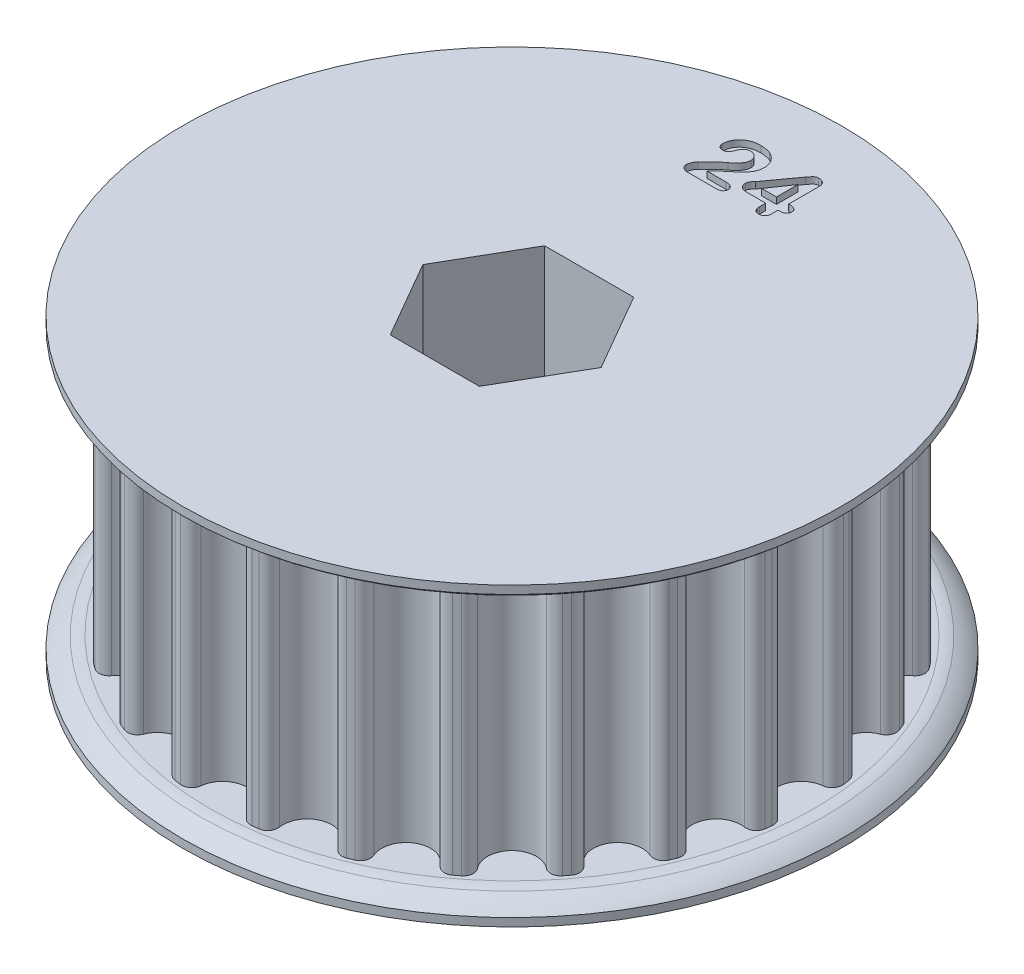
from build123d import *

# Parameters (mm, degrees)
SKETCH1_R               = 18.527092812
TOOTHOD_DEPTH           = 7.9375
TOOTHPROFILE_DEPTH      = 31.635305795
TOOTHPATTERN_COUNT      = 24
BORE_DEPTH              = 31.41244327
BORE_DEPTH_BACK         = 31.41244327
LARGE_TOOTH_COUNT_DEPTH = 0.4


with BuildPart() as part:
    # Sketch1 → ToothOD (new, symmetric)
    with BuildSketch(Plane(origin=(0, 0, 0), x_dir=(1, 0, 0), z_dir=(0, 1, 0))):
        with Locations(Location((0, 0, 0), (0, 0, 270))):
            Circle(SKETCH1_R)
    extrude(amount=TOOTHOD_DEPTH, both=True)

    # Sketch2 → ToothProfile (cut, through all)
    with BuildSketch(Plane(origin=(0, 7.9375, 0), x_dir=(1, 0, 0), z_dir=(0, 1, 0))):
        with BuildLine():
            ThreePointArc((-1.51637678, 17.83014695), (0, 16.467092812), (1.51637678, 17.83014695))
            ThreePointArc((1.51637678, 17.83014695), (1.752447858, 18.259636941), (2.224012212, 18.393122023))
            ThreePointArc((2.224012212, 18.393122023), (0, 18.527092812), (-2.224012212, 18.393122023))
            ThreePointArc((-2.224012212, 18.393122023), (-1.752447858, 18.259636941), (-1.51637678, 17.83014695))
        make_face()
    toothprofile = extrude(amount=-TOOTHPROFILE_DEPTH, mode=Mode.SUBTRACT)

    # ToothPattern: ToothProfile ×24 about axis
    toothpattern_axis = Axis((0, 0, 0), (0, 1, 0))
    for i in range(1, TOOTHPATTERN_COUNT):
        add(toothprofile.rotate(toothpattern_axis, i * 360 / TOOTHPATTERN_COUNT), mode=Mode.SUBTRACT)

    # Sketch4 → Flange (revolve)
    with BuildSketch(Plane.XY, mode=Mode.PRIVATE) as flange_sk:
        with BuildLine():
            Line((0, -7.9375), (18.781092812, -7.9375))
            ThreePointArc((18.781092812, -7.9375), (19.106848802, -7.963122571), (19.42666514, -8.030137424))
            ThreePointArc((19.42666514, -8.030137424), (19.994393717, -8.311697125), (20.495592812, -8.6995))
            Line((20.495592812, -8.6995), (20.495592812, -9.2075))
            Line((20.495592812, -9.2075), (0, -9.2075))
            Line((0, -9.2075), (0, -7.9375))
        make_face()
        with BuildLine():
            Line((20.495592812, 9.2075), (20.495592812, 8.6995))
            ThreePointArc((20.495592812, 8.6995), (19.994393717, 8.311697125), (19.42666514, 8.030137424))
            ThreePointArc((19.42666514, 8.030137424), (19.106848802, 7.963122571), (18.781092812, 7.9375))
            Line((18.781092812, 7.9375), (0, 7.9375))
            Line((0, 7.9375), (0, 9.2075))
            Line((0, 9.2075), (20.495592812, 9.2075))
        make_face()
    revolve(flange_sk.sketch.rotate(Axis((0, 7.858125, 0), (0, -1, 0)), 90), axis=Axis((0, 7.858125, 0), (0, -1, 0)))

    # Sketch7 → Bore (cut, two sides: drawn at the far end of the back side and taken through both)
    with BuildSketch(Plane.XZ.offset(-BORE_DEPTH_BACK)):
        Polygon((2.771627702, 4.8006), (-2.771627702, 4.8006), (-5.543255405, 0), (-2.771627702, -4.8006), (2.771627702, -4.8006), (5.543255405, 0), align=None)
    extrude(amount=BORE_DEPTH + BORE_DEPTH_BACK, mode=Mode.SUBTRACT)

    # Sketch9 → Large Tooth Count (cut)
    # profile 1 of 2: a face of its own
    with BuildSketch(Plane(origin=(0, 9.2075, 0), x_dir=(1, 0, 0), z_dir=(0, 1, 0))):
        with BuildLine():
            Line((-1.762125, 13.874923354), (-0.570755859, 13.874923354))
            add(Edge.make_bspline(
                [(-0.570755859, 13.874923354), (-0.533707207, 13.87398852), (-0.463545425, 13.872218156), (-0.365142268, 13.853642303), (-0.279792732, 13.823297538), (-0.208549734, 13.780908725), (-0.152090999, 13.729565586), (-0.111056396, 13.67153727), (-0.085797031, 13.607248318), (-0.082683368, 13.562107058), (-0.081111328, 13.539315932)],
                knots=[0, 0, 0, 0, 1.343135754, 2.543595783, 3.617176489, 4.61442092, 5.531765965, 6.365790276, 7.174912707, 8, 8, 8, 8], degree=3))
            add(Edge.make_bspline(
                [(-0.081111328, 13.539315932), (-0.082203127, 13.518835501), (-0.084392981, 13.477757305), (-0.104097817, 13.41789058), (-0.136223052, 13.361311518), (-0.17989453, 13.308411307), (-0.237387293, 13.262169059), (-0.311315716, 13.230655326), (-0.398880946, 13.211510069), (-0.46199946, 13.209332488), (-0.495597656, 13.208173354)],
                knots=[0, 0, 0, 0, 0.824179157, 1.653080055, 2.512971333, 3.436438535, 4.405072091, 5.457340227, 6.646533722, 8, 8, 8, 8], degree=3))
            Line((-0.495597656, 13.208173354), (-2.305347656, 13.208173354))
            add(Edge.make_bspline(
                [(-2.305347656, 13.208173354), (-2.337708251, 13.209585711), (-2.399445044, 13.212280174), (-2.487124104, 13.233091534), (-2.563929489, 13.269374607), (-2.628936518, 13.319379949), (-2.67994909, 13.379620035), (-2.717611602, 13.44590333), (-2.740998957, 13.517687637), (-2.743747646, 13.567670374), (-2.745134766, 13.592894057)],
                knots=[0, 0, 0, 0, 1.188346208, 2.267099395, 3.286301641, 4.287122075, 5.25691743, 6.166969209, 7.074964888, 8, 8, 8, 8], degree=3))
            add(Edge.make_bspline(
                [(-2.745134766, 13.592894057), (-2.744179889, 13.610580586), (-2.742139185, 13.648379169), (-2.72704257, 13.70774883), (-2.70583681, 13.773882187), (-2.675402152, 13.84383634), (-2.641188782, 13.913947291), (-2.603506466, 13.978442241), (-2.564081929, 14.035353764), (-2.534629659, 14.068174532), (-2.520404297, 14.08402687)],
                knots=[0, 0, 0, 0, 0.772497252, 1.650934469, 2.665768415, 3.807487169, 4.98083678, 6.074173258, 7.069831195, 8, 8, 8, 8], degree=3))
            add(Edge.make_bspline(
                [(-2.520404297, 14.08402687), (-2.466053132, 14.139560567), (-2.361152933, 14.246743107), (-2.205832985, 14.398276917), (-2.061164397, 14.53766544), (-1.945964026, 14.644447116), (-1.859956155, 14.722642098), (-1.801130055, 14.774408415), (-1.747617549, 14.821952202), (-1.697550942, 14.863044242), (-1.653169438, 14.900631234), (-1.612941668, 14.932596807), (-1.57736698, 14.959631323), (-1.554570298, 14.975096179), (-1.544091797, 14.982204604)],
                knots=[0, 0, 0, 0, 2.106460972, 4.065564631, 5.88232778, 7.552435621, 8.323665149, 9.033433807, 9.676767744, 10.26395234, 10.78914621, 11.253325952, 11.656791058, 12, 12, 12, 12], degree=3))
            add(Edge.make_bspline(
                [(-1.544091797, 14.982204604), (-1.512150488, 15.005011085), (-1.450036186, 15.049361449), (-1.362910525, 15.118140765), (-1.285488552, 15.187837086), (-1.215517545, 15.256252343), (-1.154259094, 15.325580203), (-1.101287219, 15.395509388), (-1.056278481, 15.465940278), (-1.018709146, 15.536455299), (-0.990117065, 15.607242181), (-0.96741796, 15.676560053), (-0.955657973, 15.745542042), (-0.953540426, 15.791049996), (-0.9525, 15.813409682)],
                knots=[0, 0, 0, 0, 1.334834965, 2.595771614, 3.772830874, 4.876488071, 5.92253324, 6.916378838, 7.85720954, 8.762924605, 9.629317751, 10.451189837, 11.239014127, 12, 12, 12, 12], degree=3))
            add(Edge.make_bspline(
                [(-0.9525, 15.813409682), (-0.95336502, 15.836539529), (-0.955052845, 15.881670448), (-0.968117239, 15.947580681), (-0.9896362, 16.009855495), (-1.020438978, 16.067574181), (-1.05762368, 16.12085656), (-1.101737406, 16.167955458), (-1.152277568, 16.208477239), (-1.208116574, 16.24252049), (-1.268172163, 16.270290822), (-1.332096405, 16.289379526), (-1.398736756, 16.301965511), (-1.444318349, 16.303181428), (-1.467445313, 16.303798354)],
                knots=[0, 0, 0, 0, 1.048524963, 2.045880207, 3.035079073, 4.026514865, 5.003545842, 5.974663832, 6.942844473, 7.932746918, 8.934660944, 9.934741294, 10.952139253, 12, 12, 12, 12], degree=3))
            add(Edge.make_bspline(
                [(-1.467445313, 16.303798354), (-1.488603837, 16.303246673), (-1.530328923, 16.302158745), (-1.591038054, 16.288605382), (-1.649193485, 16.268537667), (-1.704582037, 16.24000902), (-1.757128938, 16.202914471), (-1.806805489, 16.158002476), (-1.854552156, 16.105553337), (-1.88191115, 16.065543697), (-1.896070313, 16.044837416)],
                knots=[0, 0, 0, 0, 0.968576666, 1.910054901, 2.83824492, 3.784521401, 4.756498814, 5.779585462, 6.850863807, 8, 8, 8, 8], degree=3))
            add(Edge.make_bspline(
                [(-1.896070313, 16.044837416), (-1.898884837, 16.039169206), (-1.90725541, 16.022311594), (-1.919621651, 15.986084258), (-1.941429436, 15.932681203), (-1.964571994, 15.863127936), (-1.994294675, 15.788413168), (-2.02891906, 15.716314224), (-2.069030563, 15.652017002), (-2.110038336, 15.592107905), (-2.163240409, 15.542668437), (-2.230788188, 15.508340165), (-2.311915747, 15.488389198), (-2.370213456, 15.486338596), (-2.401341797, 15.485243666)],
                knots=[0, 0, 0, 0, 0.277128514, 0.824197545, 1.674066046, 2.805212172, 4.034469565, 5.196326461, 6.303667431, 7.353778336, 8.369399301, 9.448751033, 10.637748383, 12, 12, 12, 12], degree=3))
            add(Edge.make_bspline(
                [(-2.401341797, 15.485243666), (-2.424271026, 15.486353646), (-2.469130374, 15.488525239), (-2.533582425, 15.506574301), (-2.591105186, 15.538155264), (-2.642025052, 15.579899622), (-2.684486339, 15.632087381), (-2.713078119, 15.694699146), (-2.731809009, 15.76445846), (-2.73372109, 15.813773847), (-2.734716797, 15.839454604)],
                knots=[0, 0, 0, 0, 1.006577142, 1.969294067, 2.910545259, 3.870728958, 4.847838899, 5.837573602, 6.873926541, 8, 8, 8, 8], degree=3))
            add(Edge.make_bspline(
                [(-2.734716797, 15.839454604), (-2.733654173, 15.870272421), (-2.731508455, 15.932501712), (-2.715647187, 16.02641007), (-2.691165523, 16.121886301), (-2.656366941, 16.218238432), (-2.61099031, 16.312760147), (-2.556929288, 16.404438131), (-2.490968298, 16.489845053), (-2.417939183, 16.572390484), (-2.333218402, 16.647662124), (-2.237995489, 16.715825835), (-2.132080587, 16.775743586), (-2.016058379, 16.828333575), (-1.889529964, 16.870768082), (-1.752593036, 16.900820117), (-1.60590276, 16.920010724), (-1.504715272, 16.921932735), (-1.4525625, 16.922923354)],
                knots=[0, 0, 0, 0, 0.79066067, 1.596552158, 2.438066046, 3.318094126, 4.22076533, 5.12585777, 6.043865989, 6.985993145, 7.950839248, 8.945468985, 9.986194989, 11.068910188, 12.21037173, 13.404260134, 14.66213667, 16, 16, 16, 16], degree=3))
            add(Edge.make_bspline(
                [(-1.4525625, 16.922923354), (-1.419313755, 16.922468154), (-1.354251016, 16.921577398), (-1.258683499, 16.915382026), (-1.167205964, 16.906195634), (-1.079873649, 16.891678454), (-0.996460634, 16.874347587), (-0.917374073, 16.851581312), (-0.842094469, 16.826080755), (-0.794362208, 16.805187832), (-0.770929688, 16.794931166)],
                knots=[0, 0, 0, 0, 1.141710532, 2.234153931, 3.287715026, 4.297387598, 5.273071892, 6.211454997, 7.121975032, 8, 8, 8, 8], degree=3))
            add(Edge.make_bspline(
                [(-0.770929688, 16.794931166), (-0.737844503, 16.778689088), (-0.67280231, 16.746758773), (-0.5825276, 16.688840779), (-0.500121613, 16.625023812), (-0.427116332, 16.553849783), (-0.362358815, 16.477519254), (-0.304287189, 16.397223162), (-0.256045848, 16.310722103), (-0.215247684, 16.220671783), (-0.183300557, 16.127674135), (-0.160232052, 16.033549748), (-0.145256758, 15.938657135), (-0.143668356, 15.874980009), (-0.142875, 15.843175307)],
                knots=[0, 0, 0, 0, 1.100471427, 2.163417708, 3.198242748, 4.209796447, 5.203380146, 6.186404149, 7.165424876, 8.157237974, 9.136931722, 10.098602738, 11.050312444, 12, 12, 12, 12], degree=3))
            add(Edge.make_bspline(
                [(-0.142875, 15.843175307), (-0.144693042, 15.793175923), (-0.148288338, 15.69429892), (-0.1782964, 15.549150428), (-0.227637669, 15.410508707), (-0.295917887, 15.281042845), (-0.373499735, 15.162518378), (-0.451858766, 15.054395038), (-0.532509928, 14.961301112), (-0.602079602, 14.891836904), (-0.661927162, 14.839944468), (-0.71198559, 14.7964842), (-0.768326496, 14.748400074), (-0.831144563, 14.695093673), (-0.901057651, 14.637601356), (-0.976718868, 14.574007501), (-1.059338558, 14.506612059), (-1.146105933, 14.435918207), (-1.233051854, 14.364971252), (-1.314376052, 14.294877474), (-1.389833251, 14.229756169), (-1.4579485, 14.16759103), (-1.519166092, 14.108979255), (-1.574924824, 14.055043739), (-1.622231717, 14.003363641), (-1.651539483, 13.970210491), (-1.665386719, 13.954546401)],
                knots=[0, 0, 0, 0, 1.436599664, 2.840968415, 4.241909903, 5.655071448, 7.037977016, 8.313294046, 9.491515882, 10.57584574, 11.13676856, 11.768818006, 12.482089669, 13.266552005, 14.137751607, 15.08474532, 16.108481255, 17.203478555, 18.302996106, 19.33499709, 20.290440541, 21.168908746, 21.986178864, 22.727567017, 23.398805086, 24, 24, 24, 24], degree=3))
            add(Edge.make_bspline(
                [(-1.665386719, 13.954546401), (-1.67937404, 13.940422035), (-1.708903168, 13.910603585), (-1.743772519, 13.887226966), (-1.762125, 13.874923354)],
                knots=[0, 0, 0, 0, 0.947357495, 2, 2, 2, 2], degree=3))
        make_face()
    # profile 2 of 2: a face of its own
    with BuildSketch(Plane(origin=(0, 9.2075, 0), x_dir=(1, 0, 0), z_dir=(0, 1, 0))):
        with BuildLine():
            Line((1.80975, 13.57205812), (1.80975, 13.970173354))
            Line((1.80975, 13.970173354), (0.619869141, 13.970173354))
            add(Edge.make_bspline(
                [(0.619869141, 13.970173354), (0.580060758, 13.971403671), (0.504941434, 13.973725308), (0.399612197, 13.996090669), (0.308880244, 14.033115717), (0.23378811, 14.085812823), (0.17508516, 14.151988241), (0.133437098, 14.229970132), (0.10835603, 14.318895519), (0.105607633, 14.381762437), (0.104179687, 14.414425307)],
                knots=[0, 0, 0, 0, 1.235632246, 2.331666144, 3.326551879, 4.26108804, 5.156571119, 6.049762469, 6.986742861, 8, 8, 8, 8], degree=3))
            add(Edge.make_bspline(
                [(0.104179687, 14.414425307), (0.105289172, 14.433114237), (0.107509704, 14.470518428), (0.122419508, 14.526129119), (0.147167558, 14.580869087), (0.179036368, 14.635560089), (0.215302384, 14.689306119), (0.25135614, 14.741112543), (0.289579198, 14.787228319), (0.320714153, 14.809383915), (0.335607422, 14.819981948)],
                knots=[0, 0, 0, 0, 0.934046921, 1.869409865, 2.857765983, 3.929780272, 5.03031677, 6.097010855, 7.089713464, 8, 8, 8, 8], degree=3))
            Line((0.335607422, 14.819981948), (1.651248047, 16.621546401))
            add(Edge.make_bspline(
                [(1.651248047, 16.621546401), (1.672010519, 16.648881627), (1.711234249, 16.700522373), (1.767714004, 16.772663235), (1.822009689, 16.831716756), (1.870160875, 16.883110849), (1.920681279, 16.922964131), (1.975738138, 16.950772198), (2.036178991, 16.968047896), (2.078265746, 16.969697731), (2.099964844, 16.970548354)],
                knots=[0, 0, 0, 0, 1.390535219, 2.626950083, 3.70828158, 4.638957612, 5.476950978, 6.2991977, 7.123100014, 8, 8, 8, 8], degree=3))
            add(Edge.make_bspline(
                [(2.099964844, 16.970548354), (2.13705427, 16.969336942), (2.206795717, 16.967059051), (2.304346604, 16.944598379), (2.387634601, 16.907278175), (2.456764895, 16.854289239), (2.509498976, 16.784732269), (2.545716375, 16.700469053), (2.568239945, 16.602120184), (2.570534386, 16.53163958), (2.57175, 16.494298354)],
                knots=[0, 0, 0, 0, 1.157280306, 2.176102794, 3.10543489, 3.989019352, 4.867867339, 5.801068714, 6.834987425, 8, 8, 8, 8], degree=3))
            Line((2.57175, 16.494298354), (2.57175, 14.636923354))
            Line((2.57175, 14.636923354), (2.582912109, 14.636923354))
            add(Edge.make_bspline(
                [(2.582912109, 14.636923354), (2.617924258, 14.636065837), (2.685216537, 14.634417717), (2.781812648, 14.621940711), (2.869557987, 14.600535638), (2.936312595, 14.575122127), (2.983929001, 14.549709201), (3.014450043, 14.526162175), (3.039856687, 14.498307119), (3.060925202, 14.466683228), (3.077481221, 14.4310748), (3.089348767, 14.391514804), (3.095942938, 14.347673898), (3.096711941, 14.317213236), (3.097113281, 14.301315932)],
                knots=[0, 0, 0, 0, 1.802451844, 3.464257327, 5.003774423, 6.443421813, 7.129422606, 7.775755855, 8.417530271, 9.062220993, 9.725001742, 10.432079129, 11.18170803, 12, 12, 12, 12], degree=3))
            add(Edge.make_bspline(
                [(3.097113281, 14.301315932), (3.095830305, 14.276322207), (3.093360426, 14.228206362), (3.070041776, 14.16022645), (3.031199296, 14.101469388), (2.976466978, 14.053194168), (2.908290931, 14.014974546), (2.826064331, 13.988839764), (2.730902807, 13.972469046), (2.662858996, 13.970968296), (2.626816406, 13.970173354)],
                knots=[0, 0, 0, 0, 0.921198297, 1.773414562, 2.619992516, 3.496174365, 4.444384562, 5.487890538, 6.669343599, 8, 8, 8, 8], degree=3))
            Line((2.626816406, 13.970173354), (2.57175, 13.970173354))
            Line((2.57175, 13.970173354), (2.57175, 13.57205812))
            add(Edge.make_bspline(
                [(2.57175, 13.57205812), (2.570493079, 13.542190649), (2.568075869, 13.48475191), (2.548897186, 13.403189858), (2.515373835, 13.331314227), (2.469227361, 13.269601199), (2.409826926, 13.220201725), (2.338875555, 13.184768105), (2.256439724, 13.163621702), (2.197828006, 13.161609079), (2.1669375, 13.160548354)],
                knots=[0, 0, 0, 0, 1.0944165, 2.104694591, 3.048606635, 3.98353806, 4.906941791, 5.854614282, 6.869303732, 8, 8, 8, 8], degree=3))
            add(Edge.make_bspline(
                [(2.1669375, 13.160548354), (2.141487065, 13.161720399), (2.092205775, 13.163989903), (2.022479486, 13.184787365), (1.960074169, 13.218366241), (1.906406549, 13.265636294), (1.862355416, 13.325606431), (1.831223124, 13.397781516), (1.812444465, 13.48131692), (1.81068122, 13.540697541), (1.80975, 13.57205812)],
                knots=[0, 0, 0, 0, 0.990459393, 1.917889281, 2.809520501, 3.734930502, 4.682914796, 5.687630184, 6.778772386, 8, 8, 8, 8], degree=3))
        make_face()
        Polygon((0.89296875, 14.636923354), (1.80975, 14.636923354), (1.80975, 15.970423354), align=None, mode=Mode.SUBTRACT)
    extrude(amount=-LARGE_TOOTH_COUNT_DEPTH, mode=Mode.SUBTRACT)


solid = part.part
